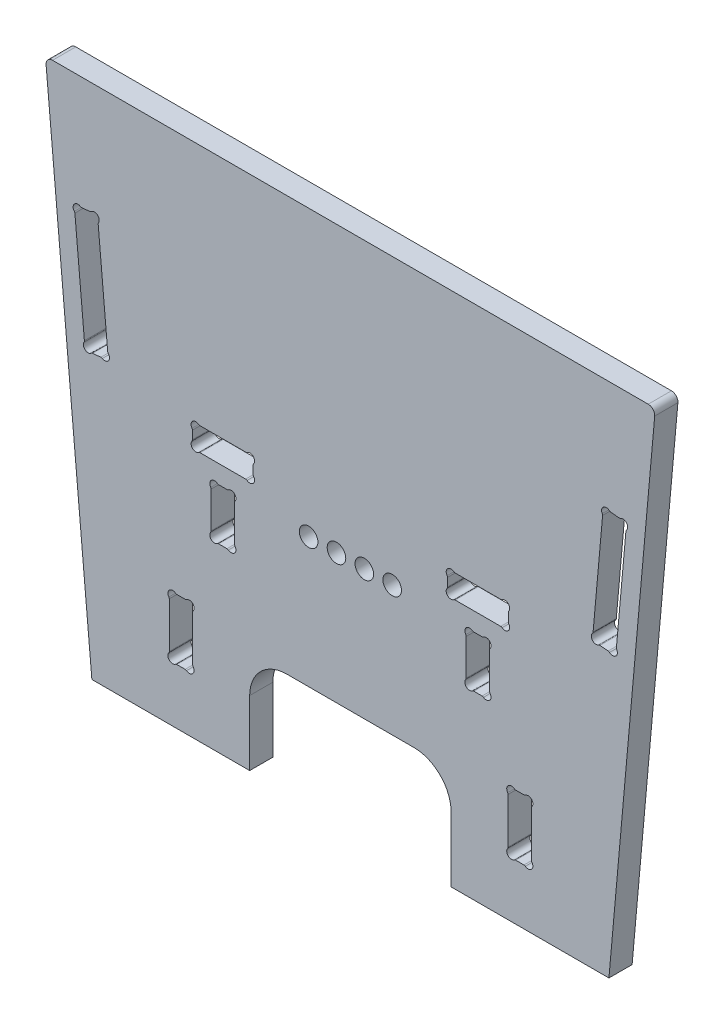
from build123d import *

# Parameters (mm, degrees)
BOSS_EXTRUDE1_DEPTH = 25
SKETCH2_R           = 10
CUT_EXTRUDE1_DEPTH  = 623.799727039
FILLET1_R           = 7


with BuildPart() as part:
    # Sketch1 → Boss-Extrude1 (new body)
    with BuildSketch(Plane.XY):
        with BuildLine():
            Line((0, 0), (-50, 556.5))
            Line((-50, 556.5), (278.5, 556.5))
            Line((278.5, 556.5), (278.5, 110))
            Line((278.5, 110), (210, 110))
            ThreePointArc((210, 110), (181.715728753, 98.284271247), (170, 70))
            Line((170, 70), (170, 0))
            Line((170, 0), (0, 0))
        make_face()
    extrude(amount=BOSS_EXTRUDE1_DEPTH)

    # Sketch2 → Cut-Extrude1 (cut, through all)
    with BuildSketch(Plane.XY):
        with Locations((233.5, 249.9)):
            Circle(SKETCH2_R)
        with Locations((263.5, 249.9)):
            Circle(SKETCH2_R)
        with BuildLine():
            Line((-8.056817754, 312.051564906), (-18.288551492, 425.930761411))
            ThreePointArc((-18.288551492, 425.930761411), (-18.484195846, 426.700054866), (-18.911140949, 427.369238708))
            ThreePointArc((-18.911140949, 427.369238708), (-19.016172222, 434.029180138), (-12.44417249, 435.113002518))
            ThreePointArc((-12.44417249, 435.113002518), (-11.709600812, 434.812181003), (-10.917753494, 434.756800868))
            Line((-10.917753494, 434.756800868), (-2.015693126, 435.556626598))
            ThreePointArc((-2.015693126, 435.556626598), (-1.24639967, 435.752270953), (-0.577215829, 436.179216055))
            ThreePointArc((-0.577215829, 436.179216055), (6.082725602, 436.284247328), (7.166547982, 429.712247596))
            ThreePointArc((7.166547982, 429.712247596), (6.865726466, 428.977675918), (6.810346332, 428.185828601))
            Line((6.810346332, 428.185828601), (17.04208007, 314.306632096))
            ThreePointArc((17.04208007, 314.306632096), (17.237724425, 313.53733864), (17.664669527, 312.868154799))
            ThreePointArc((17.664669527, 312.868154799), (17.7697008, 306.208213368), (11.197701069, 305.124390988))
            ThreePointArc((11.197701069, 305.124390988), (10.463129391, 305.425212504), (9.671282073, 305.480592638))
            Line((9.671282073, 305.480592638), (0.769221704, 304.680766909))
            ThreePointArc((0.769221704, 304.680766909), (-7.1751e-05, 304.485122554), (-0.669255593, 304.058177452))
            ThreePointArc((-0.669255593, 304.058177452), (-7.329197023, 303.953146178), (-8.413019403, 310.52514591))
            ThreePointArc((-8.413019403, 310.52514591), (-8.112197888, 311.259717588), (-8.056817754, 312.051564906))
        make_face()
        with BuildLine():
            Line((165.668959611, 269.8), (116.531040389, 269.8))
            ThreePointArc((116.531040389, 269.8), (115.747325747, 269.673982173), (115.042620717, 269.308633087))
            ThreePointArc((115.042620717, 269.308633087), (108.4, 269.8), (107.908633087, 276.442620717))
            ThreePointArc((107.908633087, 276.442620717), (108.273982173, 277.147325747), (108.4, 277.931040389))
            Line((108.4, 277.931040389), (108.4, 286.868959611))
            ThreePointArc((108.4, 286.868959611), (108.273982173, 287.652674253), (107.908633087, 288.357379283))
            ThreePointArc((107.908633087, 288.357379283), (108.4, 295), (115.042620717, 295.491366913))
            ThreePointArc((115.042620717, 295.491366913), (115.747325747, 295.126017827), (116.531040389, 295))
            Line((116.531040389, 295), (165.668959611, 295))
            ThreePointArc((165.668959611, 295), (166.452674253, 295.126017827), (167.157379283, 295.491366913))
            ThreePointArc((167.157379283, 295.491366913), (173.8, 295), (174.291366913, 288.357379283))
            ThreePointArc((174.291366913, 288.357379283), (173.926017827, 287.652674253), (173.8, 286.868959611))
            Line((173.8, 286.868959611), (173.8, 277.931040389))
            ThreePointArc((173.8, 277.931040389), (173.926017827, 277.147325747), (174.291366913, 276.442620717))
            ThreePointArc((174.291366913, 276.442620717), (173.8, 269.8), (167.157379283, 269.308633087))
            ThreePointArc((167.157379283, 269.308633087), (166.452674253, 269.673982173), (165.668959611, 269.8))
        make_face()
        with BuildLine():
            Line((128.5, 202.931040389), (128.5, 241.868959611))
            ThreePointArc((128.5, 241.868959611), (128.373982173, 242.652674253), (128.008633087, 243.357379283))
            ThreePointArc((128.008633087, 243.357379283), (128.5, 250), (135.142620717, 250.491366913))
            ThreePointArc((135.142620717, 250.491366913), (135.847325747, 250.126017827), (136.631040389, 250))
            Line((136.631040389, 250), (145.568959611, 250))
            ThreePointArc((145.568959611, 250), (146.352674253, 250.126017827), (147.057379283, 250.491366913))
            ThreePointArc((147.057379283, 250.491366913), (153.7, 250), (154.191366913, 243.357379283))
            ThreePointArc((154.191366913, 243.357379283), (153.826017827, 242.652674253), (153.7, 241.868959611))
            Line((153.7, 241.868959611), (153.7, 202.931040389))
            ThreePointArc((153.7, 202.931040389), (153.826017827, 202.147325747), (154.191366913, 201.442620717))
            ThreePointArc((154.191366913, 201.442620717), (153.7, 194.8), (147.057379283, 194.308633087))
            ThreePointArc((147.057379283, 194.308633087), (146.352674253, 194.673982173), (145.568959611, 194.8))
            Line((145.568959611, 194.8), (136.631040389, 194.8))
            ThreePointArc((136.631040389, 194.8), (135.847325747, 194.673982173), (135.142620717, 194.308633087))
            ThreePointArc((135.142620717, 194.308633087), (128.5, 194.8), (128.008633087, 201.442620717))
            ThreePointArc((128.008633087, 201.442620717), (128.373982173, 202.147325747), (128.5, 202.931040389))
        make_face()
        with BuildLine():
            Line((83.4, 67.831040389), (83.4, 116.968959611))
            ThreePointArc((83.4, 116.968959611), (83.273982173, 117.752674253), (82.908633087, 118.457379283))
            ThreePointArc((82.908633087, 118.457379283), (83.4, 125.1), (90.042620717, 125.591366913))
            ThreePointArc((90.042620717, 125.591366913), (90.747325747, 125.226017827), (91.531040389, 125.1))
            Line((91.531040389, 125.1), (100.468959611, 125.1))
            ThreePointArc((100.468959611, 125.1), (101.252674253, 125.226017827), (101.957379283, 125.591366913))
            ThreePointArc((101.957379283, 125.591366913), (108.6, 125.1), (109.091366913, 118.457379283))
            ThreePointArc((109.091366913, 118.457379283), (108.726017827, 117.752674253), (108.6, 116.968959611))
            Line((108.6, 116.968959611), (108.6, 67.831040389))
            ThreePointArc((108.6, 67.831040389), (108.726017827, 67.047325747), (109.091366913, 66.342620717))
            ThreePointArc((109.091366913, 66.342620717), (108.6, 59.7), (101.957379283, 59.208633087))
            ThreePointArc((101.957379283, 59.208633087), (101.252674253, 59.573982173), (100.468959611, 59.7))
            Line((100.468959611, 59.7), (91.531040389, 59.7))
            ThreePointArc((91.531040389, 59.7), (90.747325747, 59.573982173), (90.042620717, 59.208633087))
            ThreePointArc((90.042620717, 59.208633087), (83.4, 59.7), (82.908633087, 66.342620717))
            ThreePointArc((82.908633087, 66.342620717), (83.273982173, 67.047325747), (83.4, 67.831040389))
        make_face()
    extrude(amount=CUT_EXTRUDE1_DEPTH, mode=Mode.SUBTRACT)

    # Fillet1
    fillet1_edges = [part.edges().sort_by_distance(p)[0] for p in [
        (-50, 556.5, 12.5),
    ]]
    fillet(fillet1_edges, radius=FILLET1_R)

    # Sym_trie1: part across plane


with BuildPart() as part_1:
    add(part.part)
    add(part.part.mirror(Plane(origin=(278.5, 556.5, 25), x_dir=(0, 0, 1), z_dir=(-1, 0, 0))))


solid = part_1.part
